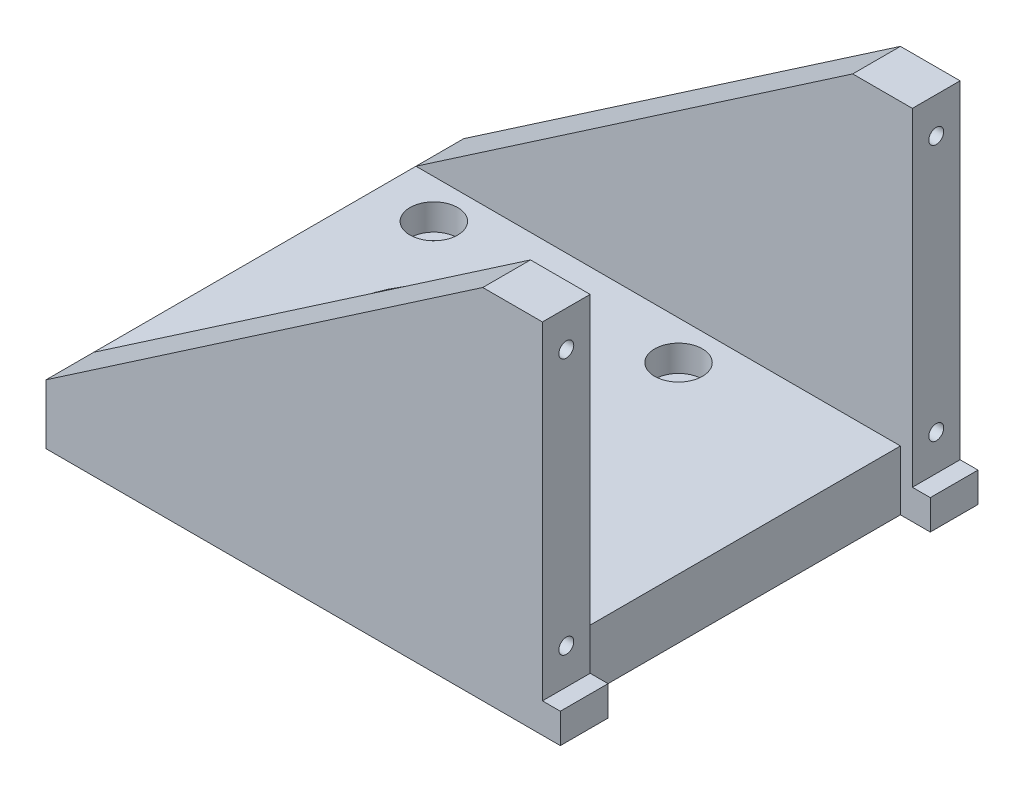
ISO-10303-21;
HEADER;
FILE_DESCRIPTION(('STEP AP214'),'2;1');
FILE_NAME('part.step','',(''),(''),'','','');
FILE_SCHEMA(('AUTOMOTIVE_DESIGN { 1 0 10303 214 1 1 1 1 }'));
ENDSEC;
DATA;
#1=APPLICATION_CONTEXT('core data for automotive mechanical design processes');
#2=APPLICATION_PROTOCOL_DEFINITION('international standard','automotive_design',2000,#1);
#3=PRODUCT_CONTEXT('',#1,'mechanical');
#4=PRODUCT('Part','Part','',(#3));
#5=PRODUCT_RELATED_PRODUCT_CATEGORY('part','',(#4));
#6=PRODUCT_DEFINITION_FORMATION('','',#4);
#7=PRODUCT_DEFINITION_CONTEXT('part definition',#1,'design');
#8=PRODUCT_DEFINITION('design','',#6,#7);
#9=PRODUCT_DEFINITION_SHAPE('','',#8);
#10=(LENGTH_UNIT() NAMED_UNIT(*) SI_UNIT(.MILLI.,.METRE.));
#11=(NAMED_UNIT(*) PLANE_ANGLE_UNIT() SI_UNIT($,.RADIAN.));
#12=(NAMED_UNIT(*) SI_UNIT($,.STERADIAN.) SOLID_ANGLE_UNIT());
#13=UNCERTAINTY_MEASURE_WITH_UNIT(LENGTH_MEASURE(1.E-05),#10,'distance_accuracy_value','');
#14=(GEOMETRIC_REPRESENTATION_CONTEXT(3) GLOBAL_UNCERTAINTY_ASSIGNED_CONTEXT((#13)) GLOBAL_UNIT_ASSIGNED_CONTEXT((#10,
#11,#12)) REPRESENTATION_CONTEXT('',''));
#15=CARTESIAN_POINT('',(0.,0.,0.));
#16=DIRECTION('',(0.,0.,1.));
#17=DIRECTION('',(1.,0.,0.));
#18=AXIS2_PLACEMENT_3D('',#15,#16,#17);
#19=CARTESIAN_POINT('',(-30.,0.,35.));
#20=DIRECTION('',(0.,1.,0.));
#21=DIRECTION('',(0.,0.,1.));
#22=AXIS2_PLACEMENT_3D('',#19,#20,#21);
#23=PLANE('',#22);
#24=CARTESIAN_POINT('',(20.5060966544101,0.,20.5060966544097));
#25=DIRECTION('',(0.,1.,0.));
#26=DIRECTION('',(0.,0.,1.));
#27=AXIS2_PLACEMENT_3D('',#24,#25,#26);
#28=CIRCLE('',#27,2.25);
#29=CARTESIAN_POINT('',(20.5060966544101,0.,22.7560966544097));
#30=VERTEX_POINT('',#29);
#31=EDGE_CURVE('E197',#30,#30,#28,.T.);
#32=ORIENTED_EDGE('',*,*,#31,.T.);
#33=EDGE_LOOP('',(#32));
#34=FACE_BOUND('',#33,.T.);
#35=CARTESIAN_POINT('',(-20.5060966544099,0.,20.5060966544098));
#36=DIRECTION('',(0.,1.,0.));
#37=DIRECTION('',(0.,0.,1.));
#38=AXIS2_PLACEMENT_3D('',#35,#36,#37);
#39=CIRCLE('',#38,2.25);
#40=CARTESIAN_POINT('',(-20.5060966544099,0.,22.7560966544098));
#41=VERTEX_POINT('',#40);
#42=EDGE_CURVE('E209',#41,#41,#39,.T.);
#43=ORIENTED_EDGE('',*,*,#42,.T.);
#44=EDGE_LOOP('',(#43));
#45=FACE_BOUND('',#44,.T.);
#46=CARTESIAN_POINT('',(-20.5060966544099,0.,-20.5060966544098));
#47=DIRECTION('',(0.,1.,0.));
#48=DIRECTION('',(0.,0.,1.));
#49=AXIS2_PLACEMENT_3D('',#46,#47,#48);
#50=CIRCLE('',#49,2.25);
#51=CARTESIAN_POINT('',(-20.5060966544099,0.,-18.2560966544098));
#52=VERTEX_POINT('',#51);
#53=EDGE_CURVE('E221',#52,#52,#50,.T.);
#54=ORIENTED_EDGE('',*,*,#53,.T.);
#55=EDGE_LOOP('',(#54));
#56=FACE_BOUND('',#55,.T.);
#57=CARTESIAN_POINT('',(20.5060966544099,0.,-20.5060966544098));
#58=DIRECTION('',(0.,1.,0.));
#59=DIRECTION('',(0.,0.,1.));
#60=AXIS2_PLACEMENT_3D('',#57,#58,#59);
#61=CIRCLE('',#60,2.25);
#62=CARTESIAN_POINT('',(20.5060966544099,0.,-18.2560966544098));
#63=VERTEX_POINT('',#62);
#64=EDGE_CURVE('E233',#63,#63,#61,.T.);
#65=ORIENTED_EDGE('',*,*,#64,.T.);
#66=EDGE_LOOP('',(#65));
#67=FACE_BOUND('',#66,.T.);
#68=CARTESIAN_POINT('',(0.,0.,0.));
#69=DIRECTION('',(0.,1.,0.));
#70=DIRECTION('',(-1.,0.,0.));
#71=AXIS2_PLACEMENT_3D('',#68,#69,#70);
#72=CIRCLE('',#71,24.05);
#73=CARTESIAN_POINT('',(-24.05,0.,0.));
#74=VERTEX_POINT('',#73);
#75=EDGE_CURVE('E277',#74,#74,#72,.T.);
#76=ORIENTED_EDGE('',*,*,#75,.T.);
#77=EDGE_LOOP('',(#76));
#78=FACE_BOUND('',#77,.T.);
#79=DIRECTION('',(-1.,0.,0.));
#80=VECTOR('',#79,1.);
#81=CARTESIAN_POINT('',(56.2,0.,27.));
#82=LINE('',#81,#80);
#83=CARTESIAN_POINT('',(56.2,0.,27.));
#84=VERTEX_POINT('',#83);
#85=CARTESIAN_POINT('',(51.2,0.,27.));
#86=VERTEX_POINT('',#85);
#87=EDGE_CURVE('E251',#84,#86,#82,.T.);
#88=ORIENTED_EDGE('',*,*,#87,.F.);
#89=DIRECTION('',(0.,0.,-1.));
#90=VECTOR('',#89,1.);
#91=CARTESIAN_POINT('',(56.2,0.,35.));
#92=LINE('',#91,#90);
#93=CARTESIAN_POINT('',(56.2,0.,35.));
#94=VERTEX_POINT('',#93);
#95=EDGE_CURVE('E338',#94,#84,#92,.T.);
#96=ORIENTED_EDGE('',*,*,#95,.F.);
#97=DIRECTION('',(1.,0.,0.));
#98=VECTOR('',#97,1.);
#99=CARTESIAN_POINT('',(-30.,0.,35.));
#100=LINE('',#99,#98);
#101=CARTESIAN_POINT('',(-30.,0.,35.));
#102=VERTEX_POINT('',#101);
#103=EDGE_CURVE('E293',#102,#94,#100,.T.);
#104=ORIENTED_EDGE('',*,*,#103,.F.);
#105=DIRECTION('',(0.,0.,-1.));
#106=VECTOR('',#105,1.);
#107=CARTESIAN_POINT('',(-30.,0.,35.));
#108=LINE('',#107,#106);
#109=CARTESIAN_POINT('',(-30.,0.,-35.));
#110=VERTEX_POINT('',#109);
#111=EDGE_CURVE('E341',#102,#110,#108,.T.);
#112=ORIENTED_EDGE('',*,*,#111,.T.);
#113=DIRECTION('',(1.,0.,0.));
#114=VECTOR('',#113,1.);
#115=CARTESIAN_POINT('',(-30.,0.,-35.));
#116=LINE('',#115,#114);
#117=CARTESIAN_POINT('',(56.2,0.,-35.));
#118=VERTEX_POINT('',#117);
#119=EDGE_CURVE('E308',#110,#118,#116,.T.);
#120=ORIENTED_EDGE('',*,*,#119,.T.);
#121=CARTESIAN_POINT('',(56.2,0.,-27.));
#122=VERTEX_POINT('',#121);
#123=EDGE_CURVE('E337',#122,#118,#92,.T.);
#124=ORIENTED_EDGE('',*,*,#123,.F.);
#125=DIRECTION('',(-1.,0.,0.));
#126=VECTOR('',#125,1.);
#127=CARTESIAN_POINT('',(56.2,0.,-27.));
#128=LINE('',#127,#126);
#129=CARTESIAN_POINT('',(51.2,0.,-27.));
#130=VERTEX_POINT('',#129);
#131=EDGE_CURVE('E248',#122,#130,#128,.T.);
#132=ORIENTED_EDGE('',*,*,#131,.T.);
#133=DIRECTION('',(0.,0.,-1.));
#134=VECTOR('',#133,1.);
#135=CARTESIAN_POINT('',(51.2,0.,27.));
#136=LINE('',#135,#134);
#137=EDGE_CURVE('E239',#86,#130,#136,.T.);
#138=ORIENTED_EDGE('',*,*,#137,.F.);
#139=EDGE_LOOP('',(#88,#96,#104,#112,#120,#124,#132,#138));
#140=FACE_BOUND('',#139,.T.);
#141=ADVANCED_FACE('F37',(#34,#45,#56,#67,#78,#140),#23,.F.);
#142=CARTESIAN_POINT('',(56.2,5.,35.));
#143=DIRECTION('',(-1.,0.,0.));
#144=DIRECTION('',(0.,0.,1.));
#145=AXIS2_PLACEMENT_3D('',#142,#143,#144);
#146=PLANE('',#145);
#147=DIRECTION('',(0.,-1.,0.));
#148=VECTOR('',#147,1.);
#149=CARTESIAN_POINT('',(56.2,10.,27.));
#150=LINE('',#149,#148);
#151=CARTESIAN_POINT('',(56.2,5.,27.));
#152=VERTEX_POINT('',#151);
#153=EDGE_CURVE('E244',#152,#84,#150,.T.);
#154=ORIENTED_EDGE('',*,*,#153,.F.);
#155=DIRECTION('',(0.,0.,-1.));
#156=VECTOR('',#155,1.);
#157=CARTESIAN_POINT('',(56.2,5.,35.));
#158=LINE('',#157,#156);
#159=CARTESIAN_POINT('',(56.2,5.,35.));
#160=VERTEX_POINT('',#159);
#161=EDGE_CURVE('E334',#160,#152,#158,.T.);
#162=ORIENTED_EDGE('',*,*,#161,.F.);
#163=DIRECTION('',(0.,1.,0.));
#164=VECTOR('',#163,1.);
#165=CARTESIAN_POINT('',(56.2,5.,35.));
#166=LINE('',#165,#164);
#167=EDGE_CURVE('E295',#94,#160,#166,.T.);
#168=ORIENTED_EDGE('',*,*,#167,.F.);
#169=ORIENTED_EDGE('',*,*,#95,.T.);
#170=EDGE_LOOP('',(#154,#162,#168,#169));
#171=FACE_BOUND('',#170,.T.);
#172=ADVANCED_FACE('F412',(#171),#146,.F.);
#173=DIRECTION('',(0.,1.,0.));
#174=VECTOR('',#173,1.);
#175=CARTESIAN_POINT('',(56.2,10.,-27.));
#176=LINE('',#175,#174);
#177=CARTESIAN_POINT('',(56.2,5.,-27.));
#178=VERTEX_POINT('',#177);
#179=EDGE_CURVE('E246',#122,#178,#176,.T.);
#180=ORIENTED_EDGE('',*,*,#179,.F.);
#181=ORIENTED_EDGE('',*,*,#123,.T.);
#182=DIRECTION('',(0.,1.,0.));
#183=VECTOR('',#182,1.);
#184=CARTESIAN_POINT('',(56.2,5.,-35.));
#185=LINE('',#184,#183);
#186=CARTESIAN_POINT('',(56.2,5.,-35.));
#187=VERTEX_POINT('',#186);
#188=EDGE_CURVE('E311',#118,#187,#185,.T.);
#189=ORIENTED_EDGE('',*,*,#188,.T.);
#190=EDGE_CURVE('E333',#178,#187,#158,.T.);
#191=ORIENTED_EDGE('',*,*,#190,.F.);
#192=EDGE_LOOP('',(#180,#181,#189,#191));
#193=FACE_BOUND('',#192,.T.);
#194=ADVANCED_FACE('F382',(#193),#146,.F.);
#195=CARTESIAN_POINT('',(53.2,5.,35.));
#196=DIRECTION('',(0.,-1.,0.));
#197=DIRECTION('',(0.,0.,-1.));
#198=AXIS2_PLACEMENT_3D('',#195,#196,#197);
#199=PLANE('',#198);
#200=DIRECTION('',(1.,0.,0.));
#201=VECTOR('',#200,1.);
#202=CARTESIAN_POINT('',(53.2,5.,27.));
#203=LINE('',#202,#201);
#204=CARTESIAN_POINT('',(53.2,5.,27.));
#205=VERTEX_POINT('',#204);
#206=EDGE_CURVE('E255',#205,#152,#203,.T.);
#207=ORIENTED_EDGE('',*,*,#206,.F.);
#208=DIRECTION('',(0.,0.,-1.));
#209=VECTOR('',#208,1.);
#210=CARTESIAN_POINT('',(53.2,5.,35.));
#211=LINE('',#210,#209);
#212=CARTESIAN_POINT('',(53.2,5.,35.));
#213=VERTEX_POINT('',#212);
#214=EDGE_CURVE('E330',#213,#205,#211,.T.);
#215=ORIENTED_EDGE('',*,*,#214,.F.);
#216=DIRECTION('',(-1.,0.,0.));
#217=VECTOR('',#216,1.);
#218=CARTESIAN_POINT('',(53.2,5.,35.));
#219=LINE('',#218,#217);
#220=EDGE_CURVE('E297',#160,#213,#219,.T.);
#221=ORIENTED_EDGE('',*,*,#220,.F.);
#222=ORIENTED_EDGE('',*,*,#161,.T.);
#223=EDGE_LOOP('',(#207,#215,#221,#222));
#224=FACE_BOUND('',#223,.T.);
#225=ADVANCED_FACE('F407',(#224),#199,.F.);
#226=DIRECTION('',(-1.,0.,0.));
#227=VECTOR('',#226,1.);
#228=CARTESIAN_POINT('',(53.2,5.,-27.));
#229=LINE('',#228,#227);
#230=CARTESIAN_POINT('',(53.2,5.,-27.));
#231=VERTEX_POINT('',#230);
#232=EDGE_CURVE('E253',#178,#231,#229,.T.);
#233=ORIENTED_EDGE('',*,*,#232,.F.);
#234=ORIENTED_EDGE('',*,*,#190,.T.);
#235=DIRECTION('',(-1.,0.,0.));
#236=VECTOR('',#235,1.);
#237=CARTESIAN_POINT('',(53.2,5.,-35.));
#238=LINE('',#237,#236);
#239=CARTESIAN_POINT('',(53.2,5.,-35.));
#240=VERTEX_POINT('',#239);
#241=EDGE_CURVE('E314',#187,#240,#238,.T.);
#242=ORIENTED_EDGE('',*,*,#241,.T.);
#243=EDGE_CURVE('E329',#231,#240,#211,.T.);
#244=ORIENTED_EDGE('',*,*,#243,.F.);
#245=EDGE_LOOP('',(#233,#234,#242,#244));
#246=FACE_BOUND('',#245,.T.);
#247=ADVANCED_FACE('F385',(#246),#199,.F.);
#248=CARTESIAN_POINT('',(53.2,5.,35.));
#249=DIRECTION('',(-1.,0.,0.));
#250=DIRECTION('',(0.,0.,1.));
#251=AXIS2_PLACEMENT_3D('',#248,#249,#250);
#252=PLANE('',#251);
#253=CARTESIAN_POINT('',(53.2,11.,31.));
#254=DIRECTION('',(1.,0.,0.));
#255=DIRECTION('',(0.,0.,-1.));
#256=AXIS2_PLACEMENT_3D('',#253,#254,#255);
#257=CIRCLE('',#256,1.25);
#258=CARTESIAN_POINT('',(53.2,11.,29.75));
#259=VERTEX_POINT('',#258);
#260=EDGE_CURVE('E166',#259,#259,#257,.T.);
#261=ORIENTED_EDGE('',*,*,#260,.F.);
#262=EDGE_LOOP('',(#261));
#263=FACE_BOUND('',#262,.T.);
#264=CARTESIAN_POINT('',(53.2,54.,31.));
#265=DIRECTION('',(1.,0.,0.));
#266=DIRECTION('',(0.,0.,-1.));
#267=AXIS2_PLACEMENT_3D('',#264,#265,#266);
#268=CIRCLE('',#267,1.25);
#269=CARTESIAN_POINT('',(53.2,54.,29.75));
#270=VERTEX_POINT('',#269);
#271=EDGE_CURVE('E165',#270,#270,#268,.T.);
#272=ORIENTED_EDGE('',*,*,#271,.F.);
#273=EDGE_LOOP('',(#272));
#274=FACE_BOUND('',#273,.T.);
#275=ORIENTED_EDGE('',*,*,#214,.T.);
#276=DIRECTION('',(0.,1.,0.));
#277=VECTOR('',#276,1.);
#278=CARTESIAN_POINT('',(53.2,5.,27.));
#279=LINE('',#278,#277);
#280=CARTESIAN_POINT('',(53.2,60.,27.));
#281=VERTEX_POINT('',#280);
#282=EDGE_CURVE('E271',#205,#281,#279,.T.);
#283=ORIENTED_EDGE('',*,*,#282,.T.);
#284=DIRECTION('',(0.,0.,-1.));
#285=VECTOR('',#284,1.);
#286=CARTESIAN_POINT('',(53.2,60.,35.));
#287=LINE('',#286,#285);
#288=CARTESIAN_POINT('',(53.2,60.,35.));
#289=VERTEX_POINT('',#288);
#290=EDGE_CURVE('E326',#289,#281,#287,.T.);
#291=ORIENTED_EDGE('',*,*,#290,.F.);
#292=DIRECTION('',(0.,1.,0.));
#293=VECTOR('',#292,1.);
#294=CARTESIAN_POINT('',(53.2,5.,35.));
#295=LINE('',#294,#293);
#296=EDGE_CURVE('E299',#213,#289,#295,.T.);
#297=ORIENTED_EDGE('',*,*,#296,.F.);
#298=EDGE_LOOP('',(#275,#283,#291,#297));
#299=FACE_BOUND('',#298,.T.);
#300=ADVANCED_FACE('F402',(#263,#274,#299),#252,.F.);
#301=CARTESIAN_POINT('',(53.2,54.,-31.));
#302=DIRECTION('',(1.,0.,0.));
#303=DIRECTION('',(0.,0.,-1.));
#304=AXIS2_PLACEMENT_3D('',#301,#302,#303);
#305=CIRCLE('',#304,1.25);
#306=CARTESIAN_POINT('',(53.2,54.,-32.25));
#307=VERTEX_POINT('',#306);
#308=EDGE_CURVE('E176',#307,#307,#305,.T.);
#309=ORIENTED_EDGE('',*,*,#308,.F.);
#310=EDGE_LOOP('',(#309));
#311=FACE_BOUND('',#310,.T.);
#312=CARTESIAN_POINT('',(53.2,11.,-31.));
#313=DIRECTION('',(1.,0.,0.));
#314=DIRECTION('',(0.,0.,-1.));
#315=AXIS2_PLACEMENT_3D('',#312,#313,#314);
#316=CIRCLE('',#315,1.25);
#317=CARTESIAN_POINT('',(53.2,11.,-32.25));
#318=VERTEX_POINT('',#317);
#319=EDGE_CURVE('E182',#318,#318,#316,.T.);
#320=ORIENTED_EDGE('',*,*,#319,.F.);
#321=EDGE_LOOP('',(#320));
#322=FACE_BOUND('',#321,.T.);
#323=DIRECTION('',(0.,-1.,0.));
#324=VECTOR('',#323,1.);
#325=CARTESIAN_POINT('',(53.2,5.,-27.));
#326=LINE('',#325,#324);
#327=CARTESIAN_POINT('',(53.2,60.,-27.));
#328=VERTEX_POINT('',#327);
#329=EDGE_CURVE('E60',#328,#231,#326,.T.);
#330=ORIENTED_EDGE('',*,*,#329,.T.);
#331=ORIENTED_EDGE('',*,*,#243,.T.);
#332=DIRECTION('',(0.,1.,0.));
#333=VECTOR('',#332,1.);
#334=CARTESIAN_POINT('',(53.2,5.,-35.));
#335=LINE('',#334,#333);
#336=CARTESIAN_POINT('',(53.2,60.,-35.));
#337=VERTEX_POINT('',#336);
#338=EDGE_CURVE('E317',#240,#337,#335,.T.);
#339=ORIENTED_EDGE('',*,*,#338,.T.);
#340=EDGE_CURVE('E325',#328,#337,#287,.T.);
#341=ORIENTED_EDGE('',*,*,#340,.F.);
#342=EDGE_LOOP('',(#330,#331,#339,#341));
#343=FACE_BOUND('',#342,.T.);
#344=ADVANCED_FACE('F354',(#311,#322,#343),#252,.F.);
#345=CARTESIAN_POINT('',(-30.,10.,27.));
#346=DIRECTION('',(0.,-1.,0.));
#347=DIRECTION('',(0.,0.,-1.));
#348=AXIS2_PLACEMENT_3D('',#345,#346,#347);
#349=PLANE('',#348);
#350=CARTESIAN_POINT('',(20.5060966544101,10.,20.5060966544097));
#351=DIRECTION('',(0.,1.,0.));
#352=DIRECTION('',(0.,0.,1.));
#353=AXIS2_PLACEMENT_3D('',#350,#351,#352);
#354=CIRCLE('',#353,4.);
#355=CARTESIAN_POINT('',(20.5060966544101,10.,24.5060966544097));
#356=VERTEX_POINT('',#355);
#357=EDGE_CURVE('E188',#356,#356,#354,.T.);
#358=ORIENTED_EDGE('',*,*,#357,.F.);
#359=EDGE_LOOP('',(#358));
#360=FACE_BOUND('',#359,.T.);
#361=CARTESIAN_POINT('',(-20.5060966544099,10.,20.5060966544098));
#362=DIRECTION('',(0.,1.,0.));
#363=DIRECTION('',(0.,0.,1.));
#364=AXIS2_PLACEMENT_3D('',#361,#362,#363);
#365=CIRCLE('',#364,4.);
#366=CARTESIAN_POINT('',(-20.5060966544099,10.,24.5060966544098));
#367=VERTEX_POINT('',#366);
#368=EDGE_CURVE('E200',#367,#367,#365,.T.);
#369=ORIENTED_EDGE('',*,*,#368,.F.);
#370=EDGE_LOOP('',(#369));
#371=FACE_BOUND('',#370,.T.);
#372=CARTESIAN_POINT('',(-20.5060966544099,10.,-20.5060966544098));
#373=DIRECTION('',(0.,1.,0.));
#374=DIRECTION('',(0.,0.,1.));
#375=AXIS2_PLACEMENT_3D('',#372,#373,#374);
#376=CIRCLE('',#375,4.);
#377=CARTESIAN_POINT('',(-20.5060966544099,10.,-16.5060966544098));
#378=VERTEX_POINT('',#377);
#379=EDGE_CURVE('E212',#378,#378,#376,.T.);
#380=ORIENTED_EDGE('',*,*,#379,.F.);
#381=EDGE_LOOP('',(#380));
#382=FACE_BOUND('',#381,.T.);
#383=CARTESIAN_POINT('',(20.5060966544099,10.,-20.5060966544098));
#384=DIRECTION('',(0.,1.,0.));
#385=DIRECTION('',(0.,0.,1.));
#386=AXIS2_PLACEMENT_3D('',#383,#384,#385);
#387=CIRCLE('',#386,4.);
#388=CARTESIAN_POINT('',(20.5060966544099,10.,-16.5060966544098));
#389=VERTEX_POINT('',#388);
#390=EDGE_CURVE('E224',#389,#389,#387,.T.);
#391=ORIENTED_EDGE('',*,*,#390,.F.);
#392=EDGE_LOOP('',(#391));
#393=FACE_BOUND('',#392,.T.);
#394=CARTESIAN_POINT('',(0.,10.,0.));
#395=DIRECTION('',(0.,-1.,0.));
#396=DIRECTION('',(0.,0.,-1.));
#397=AXIS2_PLACEMENT_3D('',#394,#395,#396);
#398=CIRCLE('',#397,16.);
#399=CARTESIAN_POINT('',(0.,10.,-16.));
#400=VERTEX_POINT('',#399);
#401=EDGE_CURVE('E264',#400,#400,#398,.T.);
#402=ORIENTED_EDGE('',*,*,#401,.T.);
#403=EDGE_LOOP('',(#402));
#404=FACE_BOUND('',#403,.T.);
#405=DIRECTION('',(0.,0.,1.));
#406=VECTOR('',#405,1.);
#407=CARTESIAN_POINT('',(51.2,10.,27.));
#408=LINE('',#407,#406);
#409=CARTESIAN_POINT('',(51.2,10.,-27.));
#410=VERTEX_POINT('',#409);
#411=CARTESIAN_POINT('',(51.2,10.,27.));
#412=VERTEX_POINT('',#411);
#413=EDGE_CURVE('E242',#410,#412,#408,.T.);
#414=ORIENTED_EDGE('',*,*,#413,.F.);
#415=DIRECTION('',(1.,0.,0.));
#416=VECTOR('',#415,1.);
#417=CARTESIAN_POINT('',(-30.,10.,-27.));
#418=LINE('',#417,#416);
#419=CARTESIAN_POINT('',(-30.,10.,-27.));
#420=VERTEX_POINT('',#419);
#421=EDGE_CURVE('E261',#420,#410,#418,.T.);
#422=ORIENTED_EDGE('',*,*,#421,.F.);
#423=DIRECTION('',(0.,0.,-1.));
#424=VECTOR('',#423,1.);
#425=CARTESIAN_POINT('',(-30.,10.,27.));
#426=LINE('',#425,#424);
#427=CARTESIAN_POINT('',(-30.,10.,27.));
#428=VERTEX_POINT('',#427);
#429=EDGE_CURVE('E257',#428,#420,#426,.T.);
#430=ORIENTED_EDGE('',*,*,#429,.F.);
#431=DIRECTION('',(1.,0.,0.));
#432=VECTOR('',#431,1.);
#433=CARTESIAN_POINT('',(-30.,10.,27.));
#434=LINE('',#433,#432);
#435=EDGE_CURVE('E260',#428,#412,#434,.T.);
#436=ORIENTED_EDGE('',*,*,#435,.T.);
#437=EDGE_LOOP('',(#414,#422,#430,#436));
#438=FACE_BOUND('',#437,.T.);
#439=ADVANCED_FACE('F370',(#360,#371,#382,#393,#404,#438),#349,.F.);
#440=CARTESIAN_POINT('',(43.2,60.,35.));
#441=DIRECTION('',(0.564036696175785,-0.825749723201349,0.));
#442=DIRECTION('',(0.825749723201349,0.564036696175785,0.));
#443=AXIS2_PLACEMENT_3D('',#440,#441,#442);
#444=PLANE('',#443);
#445=DIRECTION('',(0.,0.,-1.));
#446=VECTOR('',#445,1.);
#447=CARTESIAN_POINT('',(43.2,60.,35.));
#448=LINE('',#447,#446);
#449=CARTESIAN_POINT('',(43.2,60.,35.));
#450=VERTEX_POINT('',#449);
#451=CARTESIAN_POINT('',(43.2,60.,27.));
#452=VERTEX_POINT('',#451);
#453=EDGE_CURVE('E322',#450,#452,#448,.T.);
#454=ORIENTED_EDGE('',*,*,#453,.T.);
#455=DIRECTION('',(-0.82574972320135,-0.564036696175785,0.));
#456=VECTOR('',#455,1.);
#457=CARTESIAN_POINT('',(43.2,60.,27.));
#458=LINE('',#457,#456);
#459=EDGE_CURVE('E274',#452,#428,#458,.T.);
#460=ORIENTED_EDGE('',*,*,#459,.T.);
#461=DIRECTION('',(0.,0.,-1.));
#462=VECTOR('',#461,1.);
#463=CARTESIAN_POINT('',(-30.,10.,35.));
#464=LINE('',#463,#462);
#465=CARTESIAN_POINT('',(-30.,10.,35.));
#466=VERTEX_POINT('',#465);
#467=EDGE_CURVE('E345',#466,#428,#464,.T.);
#468=ORIENTED_EDGE('',*,*,#467,.F.);
#469=DIRECTION('',(-0.825749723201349,-0.564036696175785,0.));
#470=VECTOR('',#469,1.);
#471=CARTESIAN_POINT('',(43.2,60.,35.));
#472=LINE('',#471,#470);
#473=EDGE_CURVE('E287',#450,#466,#472,.T.);
#474=ORIENTED_EDGE('',*,*,#473,.F.);
#475=EDGE_LOOP('',(#454,#460,#468,#474));
#476=FACE_BOUND('',#475,.T.);
#477=ADVANCED_FACE('F393',(#476),#444,.F.);
#478=CARTESIAN_POINT('',(53.2,60.,35.));
#479=DIRECTION('',(0.,-1.,0.));
#480=DIRECTION('',(0.,0.,-1.));
#481=AXIS2_PLACEMENT_3D('',#478,#479,#480);
#482=PLANE('',#481);
#483=ORIENTED_EDGE('',*,*,#290,.T.);
#484=DIRECTION('',(-1.,0.,0.));
#485=VECTOR('',#484,1.);
#486=CARTESIAN_POINT('',(53.2,60.,27.));
#487=LINE('',#486,#485);
#488=EDGE_CURVE('E12',#281,#452,#487,.T.);
#489=ORIENTED_EDGE('',*,*,#488,.T.);
#490=ORIENTED_EDGE('',*,*,#453,.F.);
#491=DIRECTION('',(-1.,0.,0.));
#492=VECTOR('',#491,1.);
#493=CARTESIAN_POINT('',(53.2,60.,35.));
#494=LINE('',#493,#492);
#495=EDGE_CURVE('E301',#289,#450,#494,.T.);
#496=ORIENTED_EDGE('',*,*,#495,.F.);
#497=EDGE_LOOP('',(#483,#489,#490,#496));
#498=FACE_BOUND('',#497,.T.);
#499=ADVANCED_FACE('F397',(#498),#482,.F.);
#500=CARTESIAN_POINT('',(-30.,10.,-35.));
#501=VERTEX_POINT('',#500);
#502=EDGE_CURVE('E344',#420,#501,#464,.T.);
#503=ORIENTED_EDGE('',*,*,#502,.F.);
#504=DIRECTION('',(0.82574972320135,0.564036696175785,0.));
#505=VECTOR('',#504,1.);
#506=CARTESIAN_POINT('',(43.2,60.,-27.));
#507=LINE('',#506,#505);
#508=CARTESIAN_POINT('',(43.2,60.,-27.));
#509=VERTEX_POINT('',#508);
#510=EDGE_CURVE('E268',#420,#509,#507,.T.);
#511=ORIENTED_EDGE('',*,*,#510,.T.);
#512=CARTESIAN_POINT('',(43.2,60.,-35.));
#513=VERTEX_POINT('',#512);
#514=EDGE_CURVE('E303',#509,#513,#448,.T.);
#515=ORIENTED_EDGE('',*,*,#514,.T.);
#516=DIRECTION('',(-0.825749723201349,-0.564036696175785,0.));
#517=VECTOR('',#516,1.);
#518=CARTESIAN_POINT('',(43.2,60.,-35.));
#519=LINE('',#518,#517);
#520=EDGE_CURVE('E286',#513,#501,#519,.T.);
#521=ORIENTED_EDGE('',*,*,#520,.T.);
#522=EDGE_LOOP('',(#503,#511,#515,#521));
#523=FACE_BOUND('',#522,.T.);
#524=ADVANCED_FACE('F39',(#523),#444,.F.);
#525=CARTESIAN_POINT('',(-30.,10.,35.));
#526=DIRECTION('',(1.,0.,0.));
#527=DIRECTION('',(0.,0.,-1.));
#528=AXIS2_PLACEMENT_3D('',#525,#526,#527);
#529=PLANE('',#528);
#530=DIRECTION('',(0.,-1.,0.));
#531=VECTOR('',#530,1.);
#532=CARTESIAN_POINT('',(-30.,10.,-35.));
#533=LINE('',#532,#531);
#534=EDGE_CURVE('E306',#501,#110,#533,.T.);
#535=ORIENTED_EDGE('',*,*,#534,.T.);
#536=ORIENTED_EDGE('',*,*,#111,.F.);
#537=DIRECTION('',(0.,-1.,0.));
#538=VECTOR('',#537,1.);
#539=CARTESIAN_POINT('',(-30.,10.,35.));
#540=LINE('',#539,#538);
#541=EDGE_CURVE('E290',#466,#102,#540,.T.);
#542=ORIENTED_EDGE('',*,*,#541,.F.);
#543=ORIENTED_EDGE('',*,*,#467,.T.);
#544=ORIENTED_EDGE('',*,*,#429,.T.);
#545=ORIENTED_EDGE('',*,*,#502,.T.);
#546=EDGE_LOOP('',(#535,#536,#542,#543,#544,#545));
#547=FACE_BOUND('',#546,.T.);
#548=ADVANCED_FACE('F389',(#547),#529,.F.);
#549=ORIENTED_EDGE('',*,*,#514,.F.);
#550=DIRECTION('',(1.,0.,0.));
#551=VECTOR('',#550,1.);
#552=CARTESIAN_POINT('',(53.2,60.,-27.));
#553=LINE('',#552,#551);
#554=EDGE_CURVE('E45',#509,#328,#553,.T.);
#555=ORIENTED_EDGE('',*,*,#554,.T.);
#556=ORIENTED_EDGE('',*,*,#340,.T.);
#557=DIRECTION('',(-1.,0.,0.));
#558=VECTOR('',#557,1.);
#559=CARTESIAN_POINT('',(53.2,60.,-35.));
#560=LINE('',#559,#558);
#561=EDGE_CURVE('E291',#337,#513,#560,.T.);
#562=ORIENTED_EDGE('',*,*,#561,.T.);
#563=EDGE_LOOP('',(#549,#555,#556,#562));
#564=FACE_BOUND('',#563,.T.);
#565=ADVANCED_FACE('F352',(#564),#482,.F.);
#566=CARTESIAN_POINT('',(0.,0.,35.));
#567=DIRECTION('',(0.,0.,1.));
#568=DIRECTION('',(1.,0.,0.));
#569=AXIS2_PLACEMENT_3D('',#566,#567,#568);
#570=PLANE('',#569);
#571=ORIENTED_EDGE('',*,*,#473,.T.);
#572=ORIENTED_EDGE('',*,*,#541,.T.);
#573=ORIENTED_EDGE('',*,*,#103,.T.);
#574=ORIENTED_EDGE('',*,*,#167,.T.);
#575=ORIENTED_EDGE('',*,*,#220,.T.);
#576=ORIENTED_EDGE('',*,*,#296,.T.);
#577=ORIENTED_EDGE('',*,*,#495,.T.);
#578=EDGE_LOOP('',(#571,#572,#573,#574,#575,#576,#577));
#579=FACE_BOUND('',#578,.T.);
#580=ADVANCED_FACE('F414',(#579),#570,.T.);
#581=CARTESIAN_POINT('',(0.,0.,-35.));
#582=DIRECTION('',(0.,0.,1.));
#583=DIRECTION('',(1.,0.,0.));
#584=AXIS2_PLACEMENT_3D('',#581,#582,#583);
#585=PLANE('',#584);
#586=ORIENTED_EDGE('',*,*,#520,.F.);
#587=ORIENTED_EDGE('',*,*,#561,.F.);
#588=ORIENTED_EDGE('',*,*,#338,.F.);
#589=ORIENTED_EDGE('',*,*,#241,.F.);
#590=ORIENTED_EDGE('',*,*,#188,.F.);
#591=ORIENTED_EDGE('',*,*,#119,.F.);
#592=ORIENTED_EDGE('',*,*,#534,.F.);
#593=EDGE_LOOP('',(#586,#587,#588,#589,#590,#591,#592));
#594=FACE_BOUND('',#593,.T.);
#595=ADVANCED_FACE('F361',(#594),#585,.F.);
#596=CARTESIAN_POINT('',(0.,90.0185088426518,0.));
#597=DIRECTION('',(0.,1.,0.));
#598=DIRECTION('',(-1.,0.,0.));
#599=AXIS2_PLACEMENT_3D('',#596,#597,#598);
#600=CYLINDRICAL_SURFACE('',#599,16.);
#601=ORIENTED_EDGE('',*,*,#401,.F.);
#602=EDGE_LOOP('',(#601));
#603=FACE_BOUND('',#602,.T.);
#604=CARTESIAN_POINT('',(0.,2.5,0.));
#605=DIRECTION('',(0.,1.,0.));
#606=DIRECTION('',(-1.,0.,0.));
#607=AXIS2_PLACEMENT_3D('',#604,#605,#606);
#608=CIRCLE('',#607,16.);
#609=CARTESIAN_POINT('',(-16.,2.5,0.));
#610=VERTEX_POINT('',#609);
#611=EDGE_CURVE('E283',#610,#610,#608,.T.);
#612=ORIENTED_EDGE('',*,*,#611,.F.);
#613=EDGE_LOOP('',(#612));
#614=FACE_BOUND('',#613,.T.);
#615=ADVANCED_FACE('F421',(#603,#614),#600,.F.);
#616=CARTESIAN_POINT('',(16.,2.5,0.));
#617=DIRECTION('',(0.,-1.,0.));
#618=DIRECTION('',(1.,0.,0.));
#619=AXIS2_PLACEMENT_3D('',#616,#617,#618);
#620=PLANE('',#619);
#621=ORIENTED_EDGE('',*,*,#611,.T.);
#622=EDGE_LOOP('',(#621));
#623=FACE_BOUND('',#622,.T.);
#624=CARTESIAN_POINT('',(0.,2.5,0.));
#625=DIRECTION('',(0.,1.,0.));
#626=DIRECTION('',(-1.,0.,0.));
#627=AXIS2_PLACEMENT_3D('',#624,#625,#626);
#628=CIRCLE('',#627,24.05);
#629=CARTESIAN_POINT('',(-24.05,2.5,0.));
#630=VERTEX_POINT('',#629);
#631=EDGE_CURVE('E280',#630,#630,#628,.T.);
#632=ORIENTED_EDGE('',*,*,#631,.F.);
#633=EDGE_LOOP('',(#632));
#634=FACE_BOUND('',#633,.T.);
#635=ADVANCED_FACE('F462',(#623,#634),#620,.T.);
#636=CARTESIAN_POINT('',(0.,90.0185088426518,0.));
#637=DIRECTION('',(0.,1.,0.));
#638=DIRECTION('',(-1.,0.,0.));
#639=AXIS2_PLACEMENT_3D('',#636,#637,#638);
#640=CYLINDRICAL_SURFACE('',#639,24.05);
#641=ORIENTED_EDGE('',*,*,#631,.T.);
#642=EDGE_LOOP('',(#641));
#643=FACE_BOUND('',#642,.T.);
#644=ORIENTED_EDGE('',*,*,#75,.F.);
#645=EDGE_LOOP('',(#644));
#646=FACE_BOUND('',#645,.T.);
#647=ADVANCED_FACE('F459',(#643,#646),#640,.F.);
#648=CARTESIAN_POINT('',(-30.,60.,27.));
#649=DIRECTION('',(0.,0.,1.));
#650=DIRECTION('',(0.,-1.,0.));
#651=AXIS2_PLACEMENT_3D('',#648,#649,#650);
#652=PLANE('',#651);
#653=ORIENTED_EDGE('',*,*,#488,.F.);
#654=ORIENTED_EDGE('',*,*,#282,.F.);
#655=ORIENTED_EDGE('',*,*,#206,.T.);
#656=ORIENTED_EDGE('',*,*,#153,.T.);
#657=ORIENTED_EDGE('',*,*,#87,.T.);
#658=DIRECTION('',(0.,-1.,0.));
#659=VECTOR('',#658,1.);
#660=CARTESIAN_POINT('',(51.2,10.,27.));
#661=LINE('',#660,#659);
#662=EDGE_CURVE('E236',#412,#86,#661,.T.);
#663=ORIENTED_EDGE('',*,*,#662,.F.);
#664=ORIENTED_EDGE('',*,*,#435,.F.);
#665=ORIENTED_EDGE('',*,*,#459,.F.);
#666=EDGE_LOOP('',(#653,#654,#655,#656,#657,#663,#664,#665));
#667=FACE_BOUND('',#666,.T.);
#668=ADVANCED_FACE('F395',(#667),#652,.F.);
#669=CARTESIAN_POINT('',(-30.,60.,-27.));
#670=DIRECTION('',(0.,0.,-1.));
#671=DIRECTION('',(0.,1.,0.));
#672=AXIS2_PLACEMENT_3D('',#669,#670,#671);
#673=PLANE('',#672);
#674=ORIENTED_EDGE('',*,*,#421,.T.);
#675=DIRECTION('',(0.,1.,0.));
#676=VECTOR('',#675,1.);
#677=CARTESIAN_POINT('',(51.2,10.,-27.));
#678=LINE('',#677,#676);
#679=EDGE_CURVE('E52',#130,#410,#678,.T.);
#680=ORIENTED_EDGE('',*,*,#679,.F.);
#681=ORIENTED_EDGE('',*,*,#131,.F.);
#682=ORIENTED_EDGE('',*,*,#179,.T.);
#683=ORIENTED_EDGE('',*,*,#232,.T.);
#684=ORIENTED_EDGE('',*,*,#329,.F.);
#685=ORIENTED_EDGE('',*,*,#554,.F.);
#686=ORIENTED_EDGE('',*,*,#510,.F.);
#687=EDGE_LOOP('',(#674,#680,#681,#682,#683,#684,#685,#686));
#688=FACE_BOUND('',#687,.T.);
#689=ADVANCED_FACE('F367',(#688),#673,.F.);
#690=CARTESIAN_POINT('',(51.2,0.,0.));
#691=DIRECTION('',(1.,0.,0.));
#692=DIRECTION('',(0.,0.,-1.));
#693=AXIS2_PLACEMENT_3D('',#690,#691,#692);
#694=PLANE('',#693);
#695=ORIENTED_EDGE('',*,*,#662,.T.);
#696=ORIENTED_EDGE('',*,*,#137,.T.);
#697=ORIENTED_EDGE('',*,*,#679,.T.);
#698=ORIENTED_EDGE('',*,*,#413,.T.);
#699=EDGE_LOOP('',(#695,#696,#697,#698));
#700=FACE_BOUND('',#699,.T.);
#701=ADVANCED_FACE('F371',(#700),#694,.T.);
#702=CARTESIAN_POINT('',(20.5060966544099,10.,-20.5060966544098));
#703=DIRECTION('',(0.,1.,0.));
#704=DIRECTION('',(0.,0.,1.));
#705=AXIS2_PLACEMENT_3D('',#702,#703,#704);
#706=CYLINDRICAL_SURFACE('',#705,2.25);
#707=ORIENTED_EDGE('',*,*,#64,.F.);
#708=EDGE_LOOP('',(#707));
#709=FACE_BOUND('',#708,.T.);
#710=CARTESIAN_POINT('',(20.5060966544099,5.59999999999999,-20.5060966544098));
#711=DIRECTION('',(0.,1.,0.));
#712=DIRECTION('',(0.,0.,1.));
#713=AXIS2_PLACEMENT_3D('',#710,#711,#712);
#714=CIRCLE('',#713,2.25);
#715=CARTESIAN_POINT('',(20.5060966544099,5.59999999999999,-18.2560966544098));
#716=VERTEX_POINT('',#715);
#717=EDGE_CURVE('E230',#716,#716,#714,.T.);
#718=ORIENTED_EDGE('',*,*,#717,.T.);
#719=EDGE_LOOP('',(#718));
#720=FACE_BOUND('',#719,.T.);
#721=ADVANCED_FACE('F507',(#709,#720),#706,.F.);
#722=CARTESIAN_POINT('',(22.7560966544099,5.59999999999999,-20.5060966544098));
#723=DIRECTION('',(0.,-1.,0.));
#724=DIRECTION('',(0.,0.,-1.));
#725=AXIS2_PLACEMENT_3D('',#722,#723,#724);
#726=PLANE('',#725);
#727=ORIENTED_EDGE('',*,*,#717,.F.);
#728=EDGE_LOOP('',(#727));
#729=FACE_BOUND('',#728,.T.);
#730=CARTESIAN_POINT('',(20.5060966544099,5.59999999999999,-20.5060966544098));
#731=DIRECTION('',(0.,1.,0.));
#732=DIRECTION('',(0.,0.,1.));
#733=AXIS2_PLACEMENT_3D('',#730,#731,#732);
#734=CIRCLE('',#733,4.);
#735=CARTESIAN_POINT('',(20.5060966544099,5.59999999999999,-16.5060966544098));
#736=VERTEX_POINT('',#735);
#737=EDGE_CURVE('E227',#736,#736,#734,.T.);
#738=ORIENTED_EDGE('',*,*,#737,.T.);
#739=EDGE_LOOP('',(#738));
#740=FACE_BOUND('',#739,.T.);
#741=ADVANCED_FACE('F513',(#729,#740),#726,.F.);
#742=CARTESIAN_POINT('',(20.5060966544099,10.,-20.5060966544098));
#743=DIRECTION('',(0.,1.,0.));
#744=DIRECTION('',(0.,0.,1.));
#745=AXIS2_PLACEMENT_3D('',#742,#743,#744);
#746=CYLINDRICAL_SURFACE('',#745,4.);
#747=ORIENTED_EDGE('',*,*,#737,.F.);
#748=EDGE_LOOP('',(#747));
#749=FACE_BOUND('',#748,.T.);
#750=ORIENTED_EDGE('',*,*,#390,.T.);
#751=EDGE_LOOP('',(#750));
#752=FACE_BOUND('',#751,.T.);
#753=ADVANCED_FACE('F521',(#749,#752),#746,.F.);
#754=CARTESIAN_POINT('',(-20.5060966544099,10.,-20.5060966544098));
#755=DIRECTION('',(0.,1.,0.));
#756=DIRECTION('',(0.,0.,1.));
#757=AXIS2_PLACEMENT_3D('',#754,#755,#756);
#758=CYLINDRICAL_SURFACE('',#757,2.25);
#759=ORIENTED_EDGE('',*,*,#53,.F.);
#760=EDGE_LOOP('',(#759));
#761=FACE_BOUND('',#760,.T.);
#762=CARTESIAN_POINT('',(-20.5060966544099,5.59999999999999,-20.5060966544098));
#763=DIRECTION('',(0.,1.,0.));
#764=DIRECTION('',(0.,0.,1.));
#765=AXIS2_PLACEMENT_3D('',#762,#763,#764);
#766=CIRCLE('',#765,2.25);
#767=CARTESIAN_POINT('',(-20.5060966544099,5.59999999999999,-18.2560966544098));
#768=VERTEX_POINT('',#767);
#769=EDGE_CURVE('E218',#768,#768,#766,.T.);
#770=ORIENTED_EDGE('',*,*,#769,.T.);
#771=EDGE_LOOP('',(#770));
#772=FACE_BOUND('',#771,.T.);
#773=ADVANCED_FACE('F529',(#761,#772),#758,.F.);
#774=CARTESIAN_POINT('',(-18.2560966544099,5.59999999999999,-20.5060966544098));
#775=DIRECTION('',(0.,-1.,0.));
#776=DIRECTION('',(0.,0.,-1.));
#777=AXIS2_PLACEMENT_3D('',#774,#775,#776);
#778=PLANE('',#777);
#779=ORIENTED_EDGE('',*,*,#769,.F.);
#780=EDGE_LOOP('',(#779));
#781=FACE_BOUND('',#780,.T.);
#782=CARTESIAN_POINT('',(-20.5060966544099,5.59999999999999,-20.5060966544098));
#783=DIRECTION('',(0.,1.,0.));
#784=DIRECTION('',(0.,0.,1.));
#785=AXIS2_PLACEMENT_3D('',#782,#783,#784);
#786=CIRCLE('',#785,4.);
#787=CARTESIAN_POINT('',(-20.5060966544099,5.59999999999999,-16.5060966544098));
#788=VERTEX_POINT('',#787);
#789=EDGE_CURVE('E215',#788,#788,#786,.T.);
#790=ORIENTED_EDGE('',*,*,#789,.T.);
#791=EDGE_LOOP('',(#790));
#792=FACE_BOUND('',#791,.T.);
#793=ADVANCED_FACE('F537',(#781,#792),#778,.F.);
#794=CARTESIAN_POINT('',(-20.5060966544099,10.,-20.5060966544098));
#795=DIRECTION('',(0.,1.,0.));
#796=DIRECTION('',(0.,0.,1.));
#797=AXIS2_PLACEMENT_3D('',#794,#795,#796);
#798=CYLINDRICAL_SURFACE('',#797,4.);
#799=ORIENTED_EDGE('',*,*,#789,.F.);
#800=EDGE_LOOP('',(#799));
#801=FACE_BOUND('',#800,.T.);
#802=ORIENTED_EDGE('',*,*,#379,.T.);
#803=EDGE_LOOP('',(#802));
#804=FACE_BOUND('',#803,.T.);
#805=ADVANCED_FACE('F545',(#801,#804),#798,.F.);
#806=CARTESIAN_POINT('',(-20.5060966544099,10.,20.5060966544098));
#807=DIRECTION('',(0.,1.,0.));
#808=DIRECTION('',(0.,0.,1.));
#809=AXIS2_PLACEMENT_3D('',#806,#807,#808);
#810=CYLINDRICAL_SURFACE('',#809,2.25);
#811=ORIENTED_EDGE('',*,*,#42,.F.);
#812=EDGE_LOOP('',(#811));
#813=FACE_BOUND('',#812,.T.);
#814=CARTESIAN_POINT('',(-20.5060966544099,5.59999999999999,20.5060966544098));
#815=DIRECTION('',(0.,1.,0.));
#816=DIRECTION('',(0.,0.,1.));
#817=AXIS2_PLACEMENT_3D('',#814,#815,#816);
#818=CIRCLE('',#817,2.25);
#819=CARTESIAN_POINT('',(-20.5060966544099,5.59999999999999,22.7560966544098));
#820=VERTEX_POINT('',#819);
#821=EDGE_CURVE('E206',#820,#820,#818,.T.);
#822=ORIENTED_EDGE('',*,*,#821,.T.);
#823=EDGE_LOOP('',(#822));
#824=FACE_BOUND('',#823,.T.);
#825=ADVANCED_FACE('F553',(#813,#824),#810,.F.);
#826=CARTESIAN_POINT('',(-18.2560966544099,5.59999999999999,20.5060966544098));
#827=DIRECTION('',(0.,-1.,0.));
#828=DIRECTION('',(0.,0.,-1.));
#829=AXIS2_PLACEMENT_3D('',#826,#827,#828);
#830=PLANE('',#829);
#831=ORIENTED_EDGE('',*,*,#821,.F.);
#832=EDGE_LOOP('',(#831));
#833=FACE_BOUND('',#832,.T.);
#834=CARTESIAN_POINT('',(-20.5060966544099,5.59999999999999,20.5060966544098));
#835=DIRECTION('',(0.,1.,0.));
#836=DIRECTION('',(0.,0.,1.));
#837=AXIS2_PLACEMENT_3D('',#834,#835,#836);
#838=CIRCLE('',#837,4.);
#839=CARTESIAN_POINT('',(-20.5060966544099,5.59999999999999,24.5060966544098));
#840=VERTEX_POINT('',#839);
#841=EDGE_CURVE('E203',#840,#840,#838,.T.);
#842=ORIENTED_EDGE('',*,*,#841,.T.);
#843=EDGE_LOOP('',(#842));
#844=FACE_BOUND('',#843,.T.);
#845=ADVANCED_FACE('F561',(#833,#844),#830,.F.);
#846=CARTESIAN_POINT('',(-20.5060966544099,10.,20.5060966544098));
#847=DIRECTION('',(0.,1.,0.));
#848=DIRECTION('',(0.,0.,1.));
#849=AXIS2_PLACEMENT_3D('',#846,#847,#848);
#850=CYLINDRICAL_SURFACE('',#849,4.);
#851=ORIENTED_EDGE('',*,*,#841,.F.);
#852=EDGE_LOOP('',(#851));
#853=FACE_BOUND('',#852,.T.);
#854=ORIENTED_EDGE('',*,*,#368,.T.);
#855=EDGE_LOOP('',(#854));
#856=FACE_BOUND('',#855,.T.);
#857=ADVANCED_FACE('F569',(#853,#856),#850,.F.);
#858=CARTESIAN_POINT('',(20.5060966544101,10.,20.5060966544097));
#859=DIRECTION('',(0.,1.,0.));
#860=DIRECTION('',(0.,0.,1.));
#861=AXIS2_PLACEMENT_3D('',#858,#859,#860);
#862=CYLINDRICAL_SURFACE('',#861,2.25);
#863=ORIENTED_EDGE('',*,*,#31,.F.);
#864=EDGE_LOOP('',(#863));
#865=FACE_BOUND('',#864,.T.);
#866=CARTESIAN_POINT('',(20.5060966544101,5.59999999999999,20.5060966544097));
#867=DIRECTION('',(0.,1.,0.));
#868=DIRECTION('',(0.,0.,1.));
#869=AXIS2_PLACEMENT_3D('',#866,#867,#868);
#870=CIRCLE('',#869,2.25);
#871=CARTESIAN_POINT('',(20.5060966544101,5.59999999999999,22.7560966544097));
#872=VERTEX_POINT('',#871);
#873=EDGE_CURVE('E194',#872,#872,#870,.T.);
#874=ORIENTED_EDGE('',*,*,#873,.T.);
#875=EDGE_LOOP('',(#874));
#876=FACE_BOUND('',#875,.T.);
#877=ADVANCED_FACE('F577',(#865,#876),#862,.F.);
#878=CARTESIAN_POINT('',(22.7560966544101,5.59999999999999,20.5060966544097));
#879=DIRECTION('',(0.,-1.,0.));
#880=DIRECTION('',(0.,0.,-1.));
#881=AXIS2_PLACEMENT_3D('',#878,#879,#880);
#882=PLANE('',#881);
#883=ORIENTED_EDGE('',*,*,#873,.F.);
#884=EDGE_LOOP('',(#883));
#885=FACE_BOUND('',#884,.T.);
#886=CARTESIAN_POINT('',(20.5060966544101,5.59999999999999,20.5060966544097));
#887=DIRECTION('',(0.,1.,0.));
#888=DIRECTION('',(0.,0.,1.));
#889=AXIS2_PLACEMENT_3D('',#886,#887,#888);
#890=CIRCLE('',#889,4.);
#891=CARTESIAN_POINT('',(20.5060966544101,5.59999999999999,24.5060966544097));
#892=VERTEX_POINT('',#891);
#893=EDGE_CURVE('E191',#892,#892,#890,.T.);
#894=ORIENTED_EDGE('',*,*,#893,.T.);
#895=EDGE_LOOP('',(#894));
#896=FACE_BOUND('',#895,.T.);
#897=ADVANCED_FACE('F585',(#885,#896),#882,.F.);
#898=CARTESIAN_POINT('',(20.5060966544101,10.,20.5060966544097));
#899=DIRECTION('',(0.,1.,0.));
#900=DIRECTION('',(0.,0.,1.));
#901=AXIS2_PLACEMENT_3D('',#898,#899,#900);
#902=CYLINDRICAL_SURFACE('',#901,4.);
#903=ORIENTED_EDGE('',*,*,#893,.F.);
#904=EDGE_LOOP('',(#903));
#905=FACE_BOUND('',#904,.T.);
#906=ORIENTED_EDGE('',*,*,#357,.T.);
#907=EDGE_LOOP('',(#906));
#908=FACE_BOUND('',#907,.T.);
#909=ADVANCED_FACE('F593',(#905,#908),#902,.F.);
#910=CARTESIAN_POINT('',(42.2,11.,-31.));
#911=DIRECTION('',(1.,0.,0.));
#912=DIRECTION('',(0.,0.,-1.));
#913=AXIS2_PLACEMENT_3D('',#910,#911,#912);
#914=CONICAL_SURFACE('',#913,1.25,1.02974425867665);
#915=CARTESIAN_POINT('',(41.4489242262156,11.,-31.));
#916=VERTEX_POINT('',#915);
#917=VERTEX_LOOP('',#916);
#918=FACE_BOUND('',#917,.T.);
#919=CARTESIAN_POINT('',(42.2,11.,-31.));
#920=DIRECTION('',(1.,0.,0.));
#921=DIRECTION('',(0.,0.,-1.));
#922=AXIS2_PLACEMENT_3D('',#919,#920,#921);
#923=CIRCLE('',#922,1.25);
#924=CARTESIAN_POINT('',(42.2,11.,-32.25));
#925=VERTEX_POINT('',#924);
#926=EDGE_CURVE('E185',#925,#925,#923,.T.);
#927=ORIENTED_EDGE('',*,*,#926,.T.);
#928=EDGE_LOOP('',(#927));
#929=FACE_BOUND('',#928,.T.);
#930=ADVANCED_FACE('F601',(#918,#929),#914,.F.);
#931=CARTESIAN_POINT('',(53.2,11.,-31.));
#932=DIRECTION('',(1.,0.,0.));
#933=DIRECTION('',(0.,0.,-1.));
#934=AXIS2_PLACEMENT_3D('',#931,#932,#933);
#935=CYLINDRICAL_SURFACE('',#934,1.25);
#936=ORIENTED_EDGE('',*,*,#926,.F.);
#937=EDGE_LOOP('',(#936));
#938=FACE_BOUND('',#937,.T.);
#939=ORIENTED_EDGE('',*,*,#319,.T.);
#940=EDGE_LOOP('',(#939));
#941=FACE_BOUND('',#940,.T.);
#942=ADVANCED_FACE('F609',(#938,#941),#935,.F.);
#943=CARTESIAN_POINT('',(42.2,54.,-31.));
#944=DIRECTION('',(1.,0.,0.));
#945=DIRECTION('',(0.,0.,-1.));
#946=AXIS2_PLACEMENT_3D('',#943,#944,#945);
#947=CONICAL_SURFACE('',#946,1.24999999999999,1.02974425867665);
#948=CARTESIAN_POINT('',(41.4489242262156,54.,-31.));
#949=VERTEX_POINT('',#948);
#950=VERTEX_LOOP('',#949);
#951=FACE_BOUND('',#950,.T.);
#952=CARTESIAN_POINT('',(42.2,54.,-31.));
#953=DIRECTION('',(1.,0.,0.));
#954=DIRECTION('',(0.,0.,-1.));
#955=AXIS2_PLACEMENT_3D('',#952,#953,#954);
#956=CIRCLE('',#955,1.24999999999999);
#957=CARTESIAN_POINT('',(42.2,54.,-32.25));
#958=VERTEX_POINT('',#957);
#959=EDGE_CURVE('E179',#958,#958,#956,.T.);
#960=ORIENTED_EDGE('',*,*,#959,.T.);
#961=EDGE_LOOP('',(#960));
#962=FACE_BOUND('',#961,.T.);
#963=ADVANCED_FACE('F618',(#951,#962),#947,.F.);
#964=CARTESIAN_POINT('',(53.2,54.,-31.));
#965=DIRECTION('',(1.,0.,0.));
#966=DIRECTION('',(0.,0.,-1.));
#967=AXIS2_PLACEMENT_3D('',#964,#965,#966);
#968=CYLINDRICAL_SURFACE('',#967,1.25);
#969=ORIENTED_EDGE('',*,*,#959,.F.);
#970=EDGE_LOOP('',(#969));
#971=FACE_BOUND('',#970,.T.);
#972=ORIENTED_EDGE('',*,*,#308,.T.);
#973=EDGE_LOOP('',(#972));
#974=FACE_BOUND('',#973,.T.);
#975=ADVANCED_FACE('F627',(#971,#974),#968,.F.);
#976=CARTESIAN_POINT('',(42.2,54.,31.));
#977=DIRECTION('',(1.,0.,0.));
#978=DIRECTION('',(0.,0.,-1.));
#979=AXIS2_PLACEMENT_3D('',#976,#977,#978);
#980=CONICAL_SURFACE('',#979,1.24999999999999,1.02974425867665);
#981=CARTESIAN_POINT('',(41.4489242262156,54.,31.));
#982=VERTEX_POINT('',#981);
#983=VERTEX_LOOP('',#982);
#984=FACE_BOUND('',#983,.T.);
#985=CARTESIAN_POINT('',(42.2,54.,31.));
#986=DIRECTION('',(1.,0.,0.));
#987=DIRECTION('',(0.,0.,-1.));
#988=AXIS2_PLACEMENT_3D('',#985,#986,#987);
#989=CIRCLE('',#988,1.24999999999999);
#990=CARTESIAN_POINT('',(42.2,54.,29.75));
#991=VERTEX_POINT('',#990);
#992=EDGE_CURVE('E169',#991,#991,#989,.T.);
#993=ORIENTED_EDGE('',*,*,#992,.T.);
#994=EDGE_LOOP('',(#993));
#995=FACE_BOUND('',#994,.T.);
#996=ADVANCED_FACE('F635',(#984,#995),#980,.F.);
#997=CARTESIAN_POINT('',(53.2,54.,31.));
#998=DIRECTION('',(1.,0.,0.));
#999=DIRECTION('',(0.,0.,-1.));
#1000=AXIS2_PLACEMENT_3D('',#997,#998,#999);
#1001=CYLINDRICAL_SURFACE('',#1000,1.25);
#1002=ORIENTED_EDGE('',*,*,#992,.F.);
#1003=EDGE_LOOP('',(#1002));
#1004=FACE_BOUND('',#1003,.T.);
#1005=ORIENTED_EDGE('',*,*,#271,.T.);
#1006=EDGE_LOOP('',(#1005));
#1007=FACE_BOUND('',#1006,.T.);
#1008=ADVANCED_FACE('F159',(#1004,#1007),#1001,.F.);
#1009=CARTESIAN_POINT('',(42.2,11.,31.));
#1010=DIRECTION('',(1.,0.,0.));
#1011=DIRECTION('',(0.,0.,-1.));
#1012=AXIS2_PLACEMENT_3D('',#1009,#1010,#1011);
#1013=CONICAL_SURFACE('',#1012,1.25,1.02974425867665);
#1014=CARTESIAN_POINT('',(41.4489242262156,11.,31.));
#1015=VERTEX_POINT('',#1014);
#1016=VERTEX_LOOP('',#1015);
#1017=FACE_BOUND('',#1016,.T.);
#1018=CARTESIAN_POINT('',(42.2,11.,31.));
#1019=DIRECTION('',(1.,0.,0.));
#1020=DIRECTION('',(0.,0.,-1.));
#1021=AXIS2_PLACEMENT_3D('',#1018,#1019,#1020);
#1022=CIRCLE('',#1021,1.25);
#1023=CARTESIAN_POINT('',(42.2,11.,29.75));
#1024=VERTEX_POINT('',#1023);
#1025=EDGE_CURVE('E163',#1024,#1024,#1022,.T.);
#1026=ORIENTED_EDGE('',*,*,#1025,.T.);
#1027=EDGE_LOOP('',(#1026));
#1028=FACE_BOUND('',#1027,.T.);
#1029=ADVANCED_FACE('F155',(#1017,#1028),#1013,.F.);
#1030=CARTESIAN_POINT('',(53.2,11.,31.));
#1031=DIRECTION('',(1.,0.,0.));
#1032=DIRECTION('',(0.,0.,-1.));
#1033=AXIS2_PLACEMENT_3D('',#1030,#1031,#1032);
#1034=CYLINDRICAL_SURFACE('',#1033,1.25);
#1035=ORIENTED_EDGE('',*,*,#1025,.F.);
#1036=EDGE_LOOP('',(#1035));
#1037=FACE_BOUND('',#1036,.T.);
#1038=ORIENTED_EDGE('',*,*,#260,.T.);
#1039=EDGE_LOOP('',(#1038));
#1040=FACE_BOUND('',#1039,.T.);
#1041=ADVANCED_FACE('F158',(#1037,#1040),#1034,.F.);
#1042=CLOSED_SHELL('',(#141,#172,#194,#225,#247,#300,#344,#439,#477,#499,#524,#548,#565,#580,
#595,#615,#635,#647,#668,#689,#701,#721,#741,#753,#773,#793,#805,#825,#845,#857,#877,#897,#909,
#930,#942,#963,#975,#996,#1008,#1029,#1041));
#1043=MANIFOLD_SOLID_BREP('B2',#1042);
#1044=ADVANCED_BREP_SHAPE_REPRESENTATION('',(#18,#1043),#14);
#1045=SHAPE_DEFINITION_REPRESENTATION(#9,#1044);
ENDSEC;
END-ISO-10303-21;
